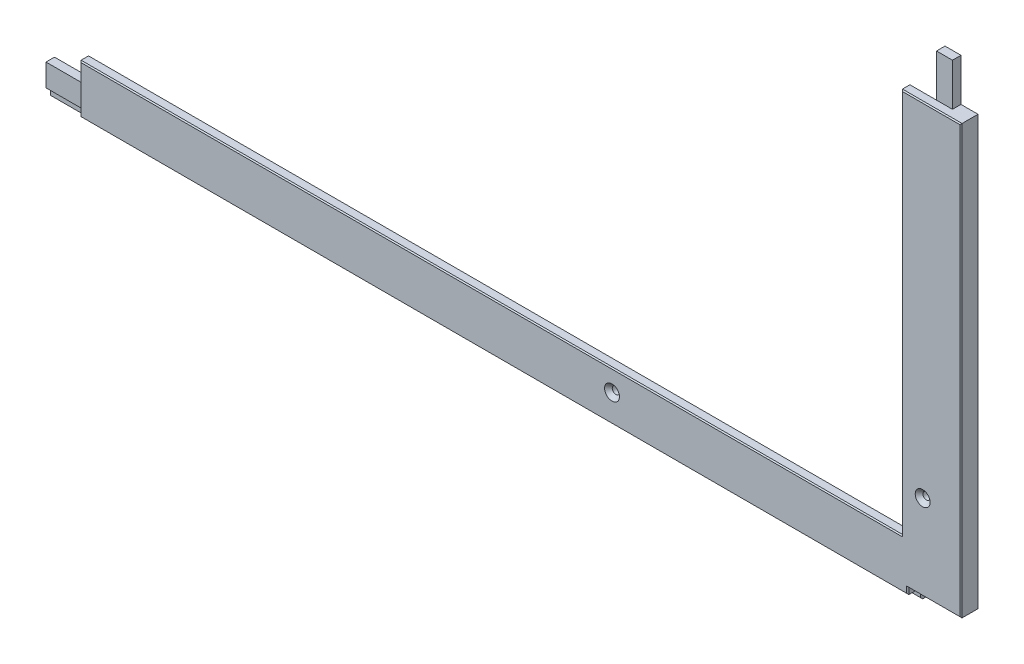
ISO-10303-21;
HEADER;
FILE_DESCRIPTION(('STEP AP214'),'2;1');
FILE_NAME('part.step','',(''),(''),'','','');
FILE_SCHEMA(('AUTOMOTIVE_DESIGN { 1 0 10303 214 1 1 1 1 }'));
ENDSEC;
DATA;
#1=APPLICATION_CONTEXT('core data for automotive mechanical design processes');
#2=APPLICATION_PROTOCOL_DEFINITION('international standard','automotive_design',2000,#1);
#3=PRODUCT_CONTEXT('',#1,'mechanical');
#4=PRODUCT('Part','Part','',(#3));
#5=PRODUCT_RELATED_PRODUCT_CATEGORY('part','',(#4));
#6=PRODUCT_DEFINITION_FORMATION('','',#4);
#7=PRODUCT_DEFINITION_CONTEXT('part definition',#1,'design');
#8=PRODUCT_DEFINITION('design','',#6,#7);
#9=PRODUCT_DEFINITION_SHAPE('','',#8);
#10=(LENGTH_UNIT() NAMED_UNIT(*) SI_UNIT(.MILLI.,.METRE.));
#11=(NAMED_UNIT(*) PLANE_ANGLE_UNIT() SI_UNIT($,.RADIAN.));
#12=(NAMED_UNIT(*) SI_UNIT($,.STERADIAN.) SOLID_ANGLE_UNIT());
#13=UNCERTAINTY_MEASURE_WITH_UNIT(LENGTH_MEASURE(1.E-05),#10,'distance_accuracy_value','');
#14=(GEOMETRIC_REPRESENTATION_CONTEXT(3) GLOBAL_UNCERTAINTY_ASSIGNED_CONTEXT((#13)) GLOBAL_UNIT_ASSIGNED_CONTEXT((#10,
#11,#12)) REPRESENTATION_CONTEXT('',''));
#15=CARTESIAN_POINT('',(0.,0.,0.));
#16=DIRECTION('',(0.,0.,1.));
#17=DIRECTION('',(1.,0.,0.));
#18=AXIS2_PLACEMENT_3D('',#15,#16,#17);
#19=CARTESIAN_POINT('',(0.,-214.25,0.));
#20=DIRECTION('',(0.,1.,0.));
#21=DIRECTION('',(0.,0.,1.));
#22=AXIS2_PLACEMENT_3D('',#19,#20,#21);
#23=PLANE('',#22);
#24=DIRECTION('',(0.,0.,1.));
#25=VECTOR('',#24,1.);
#26=CARTESIAN_POINT('',(399.,-214.25,8.));
#27=LINE('',#26,#25);
#28=CARTESIAN_POINT('',(399.,-214.25,2.));
#29=VERTEX_POINT('',#28);
#30=CARTESIAN_POINT('',(399.,-214.25,7.50000000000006));
#31=VERTEX_POINT('',#30);
#32=EDGE_CURVE('E223',#29,#31,#27,.T.);
#33=ORIENTED_EDGE('',*,*,#32,.T.);
#34=DIRECTION('',(-1.,0.,0.));
#35=VECTOR('',#34,1.);
#36=CARTESIAN_POINT('',(0.,-214.25,7.50000000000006));
#37=LINE('',#36,#35);
#38=CARTESIAN_POINT('',(9.99999999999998,-214.25,7.50000000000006));
#39=VERTEX_POINT('',#38);
#40=EDGE_CURVE('E382',#31,#39,#37,.T.);
#41=ORIENTED_EDGE('',*,*,#40,.T.);
#42=DIRECTION('',(0.,0.,-1.));
#43=VECTOR('',#42,1.);
#44=CARTESIAN_POINT('',(9.99999999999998,-214.25,8.));
#45=LINE('',#44,#43);
#46=CARTESIAN_POINT('',(10.,-214.25,4.));
#47=VERTEX_POINT('',#46);
#48=EDGE_CURVE('E241',#39,#47,#45,.T.);
#49=ORIENTED_EDGE('',*,*,#48,.T.);
#50=DIRECTION('',(-1.,0.,0.));
#51=VECTOR('',#50,1.);
#52=CARTESIAN_POINT('',(10.,-214.25,4.));
#53=LINE('',#52,#51);
#54=CARTESIAN_POINT('',(-10.,-214.25,4.));
#55=VERTEX_POINT('',#54);
#56=EDGE_CURVE('E222',#47,#55,#53,.T.);
#57=ORIENTED_EDGE('',*,*,#56,.T.);
#58=DIRECTION('',(0.,0.,-1.));
#59=VECTOR('',#58,1.);
#60=CARTESIAN_POINT('',(-10.,-214.25,4.));
#61=LINE('',#60,#59);
#62=CARTESIAN_POINT('',(-10.,-214.25,2.));
#63=VERTEX_POINT('',#62);
#64=EDGE_CURVE('E206',#55,#63,#61,.T.);
#65=ORIENTED_EDGE('',*,*,#64,.T.);
#66=DIRECTION('',(-1.,0.,0.));
#67=VECTOR('',#66,1.);
#68=CARTESIAN_POINT('',(-10.,-214.25,2.));
#69=LINE('',#68,#67);
#70=EDGE_CURVE('E219',#29,#63,#69,.T.);
#71=ORIENTED_EDGE('',*,*,#70,.F.);
#72=EDGE_LOOP('',(#33,#41,#49,#57,#65,#71));
#73=FACE_BOUND('',#72,.T.);
#74=ADVANCED_FACE('F38',(#73),#23,.F.);
#75=CARTESIAN_POINT('',(-416.,-211.25,8.));
#76=DIRECTION('',(0.,1.,0.));
#77=DIRECTION('',(0.,0.,1.));
#78=AXIS2_PLACEMENT_3D('',#75,#76,#77);
#79=PLANE('',#78);
#80=DIRECTION('',(0.,0.,-1.));
#81=VECTOR('',#80,1.);
#82=CARTESIAN_POINT('',(424.,-211.25,209.408943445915));
#83=LINE('',#82,#81);
#84=CARTESIAN_POINT('',(424.,-211.25,7.50000000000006));
#85=VERTEX_POINT('',#84);
#86=CARTESIAN_POINT('',(424.,-211.25,0.));
#87=VERTEX_POINT('',#86);
#88=EDGE_CURVE('E254',#85,#87,#83,.T.);
#89=ORIENTED_EDGE('',*,*,#88,.F.);
#90=DIRECTION('',(-1.,0.,0.));
#91=VECTOR('',#90,1.);
#92=CARTESIAN_POINT('',(-416.,-211.25,7.50000000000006));
#93=LINE('',#92,#91);
#94=CARTESIAN_POINT('',(399.,-211.25,7.50000000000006));
#95=VERTEX_POINT('',#94);
#96=EDGE_CURVE('E376',#85,#95,#93,.T.);
#97=ORIENTED_EDGE('',*,*,#96,.T.);
#98=DIRECTION('',(0.,0.,1.));
#99=VECTOR('',#98,1.);
#100=CARTESIAN_POINT('',(399.,-211.25,8.));
#101=LINE('',#100,#99);
#102=CARTESIAN_POINT('',(399.,-211.25,0.));
#103=VERTEX_POINT('',#102);
#104=EDGE_CURVE('E240',#103,#95,#101,.T.);
#105=ORIENTED_EDGE('',*,*,#104,.F.);
#106=DIRECTION('',(1.,0.,0.));
#107=VECTOR('',#106,1.);
#108=CARTESIAN_POINT('',(-416.,-211.25,0.));
#109=LINE('',#108,#107);
#110=EDGE_CURVE('E328',#103,#87,#109,.T.);
#111=ORIENTED_EDGE('',*,*,#110,.T.);
#112=EDGE_LOOP('',(#89,#97,#105,#111));
#113=FACE_BOUND('',#112,.T.);
#114=ADVANCED_FACE('F423',(#113),#79,.F.);
#115=CARTESIAN_POINT('',(396.,-191.25,8.));
#116=DIRECTION('',(-1.,0.,0.));
#117=DIRECTION('',(0.,0.,1.));
#118=AXIS2_PLACEMENT_3D('',#115,#116,#117);
#119=PLANE('',#118);
#120=DIRECTION('',(0.,0.,-1.));
#121=VECTOR('',#120,1.);
#122=CARTESIAN_POINT('',(396.,-191.25,8.));
#123=LINE('',#122,#121);
#124=CARTESIAN_POINT('',(396.,-191.25,7.50000000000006));
#125=VERTEX_POINT('',#124);
#126=CARTESIAN_POINT('',(396.,-191.25,4.));
#127=VERTEX_POINT('',#126);
#128=EDGE_CURVE('E324',#125,#127,#123,.T.);
#129=ORIENTED_EDGE('',*,*,#128,.F.);
#130=DIRECTION('',(0.,1.,0.));
#131=VECTOR('',#130,1.);
#132=CARTESIAN_POINT('',(396.,-10.,7.50000000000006));
#133=LINE('',#132,#131);
#134=CARTESIAN_POINT('',(396.,-10.,7.50000000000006));
#135=VERTEX_POINT('',#134);
#136=EDGE_CURVE('E370',#125,#135,#133,.T.);
#137=ORIENTED_EDGE('',*,*,#136,.T.);
#138=DIRECTION('',(0.,0.,-1.));
#139=VECTOR('',#138,1.);
#140=CARTESIAN_POINT('',(396.,-10.,8.00000000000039));
#141=LINE('',#140,#139);
#142=CARTESIAN_POINT('',(396.,-10.,4.));
#143=VERTEX_POINT('',#142);
#144=EDGE_CURVE('E292',#135,#143,#141,.T.);
#145=ORIENTED_EDGE('',*,*,#144,.T.);
#146=DIRECTION('',(0.,-1.,0.));
#147=VECTOR('',#146,1.);
#148=CARTESIAN_POINT('',(396.,-191.25,4.));
#149=LINE('',#148,#147);
#150=EDGE_CURVE('E321',#143,#127,#149,.T.);
#151=ORIENTED_EDGE('',*,*,#150,.T.);
#152=EDGE_LOOP('',(#129,#137,#145,#151));
#153=FACE_BOUND('',#152,.T.);
#154=ADVANCED_FACE('F502',(#153),#119,.T.);
#155=CARTESIAN_POINT('',(0.,0.,8.));
#156=DIRECTION('',(0.,0.,-1.));
#157=DIRECTION('',(-1.,0.,0.));
#158=AXIS2_PLACEMENT_3D('',#155,#156,#157);
#159=PLANE('',#158);
#160=DIRECTION('',(-1.,0.,0.));
#161=VECTOR('',#160,1.);
#162=CARTESIAN_POINT('',(9.99999999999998,-191.75,8.));
#163=LINE('',#162,#161);
#164=CARTESIAN_POINT('',(396.5,-191.75,8.));
#165=VERTEX_POINT('',#164);
#166=CARTESIAN_POINT('',(10.5,-191.75,8.));
#167=VERTEX_POINT('',#166);
#168=EDGE_CURVE('E363',#165,#167,#163,.T.);
#169=ORIENTED_EDGE('',*,*,#168,.T.);
#170=DIRECTION('',(0.,-1.,0.));
#171=VECTOR('',#170,1.);
#172=CARTESIAN_POINT('',(10.5,0.,8.));
#173=LINE('',#172,#171);
#174=CARTESIAN_POINT('',(10.5,-213.75,8.));
#175=VERTEX_POINT('',#174);
#176=EDGE_CURVE('E365',#167,#175,#173,.T.);
#177=ORIENTED_EDGE('',*,*,#176,.T.);
#178=DIRECTION('',(1.,0.,0.));
#179=VECTOR('',#178,1.);
#180=CARTESIAN_POINT('',(0.,-213.75,8.));
#181=LINE('',#180,#179);
#182=CARTESIAN_POINT('',(398.5,-213.75,8.));
#183=VERTEX_POINT('',#182);
#184=EDGE_CURVE('E351',#175,#183,#181,.T.);
#185=ORIENTED_EDGE('',*,*,#184,.T.);
#186=DIRECTION('',(0.,1.,0.));
#187=VECTOR('',#186,1.);
#188=CARTESIAN_POINT('',(398.5,0.,8.));
#189=LINE('',#188,#187);
#190=CARTESIAN_POINT('',(398.5,-210.75,8.));
#191=VERTEX_POINT('',#190);
#192=EDGE_CURVE('E353',#183,#191,#189,.T.);
#193=ORIENTED_EDGE('',*,*,#192,.T.);
#194=DIRECTION('',(1.,0.,0.));
#195=VECTOR('',#194,1.);
#196=CARTESIAN_POINT('',(0.,-210.75,8.));
#197=LINE('',#196,#195);
#198=CARTESIAN_POINT('',(423.5,-210.75,8.));
#199=VERTEX_POINT('',#198);
#200=EDGE_CURVE('E355',#191,#199,#197,.T.);
#201=ORIENTED_EDGE('',*,*,#200,.T.);
#202=DIRECTION('',(0.,1.,0.));
#203=VECTOR('',#202,1.);
#204=CARTESIAN_POINT('',(423.5,-10.,8.));
#205=LINE('',#204,#203);
#206=CARTESIAN_POINT('',(423.5,-10.5,8.));
#207=VERTEX_POINT('',#206);
#208=EDGE_CURVE('E357',#199,#207,#205,.T.);
#209=ORIENTED_EDGE('',*,*,#208,.T.);
#210=DIRECTION('',(-1.,0.,0.));
#211=VECTOR('',#210,1.);
#212=CARTESIAN_POINT('',(396.,-10.5,8.));
#213=LINE('',#212,#211);
#214=CARTESIAN_POINT('',(396.5,-10.5,8.));
#215=VERTEX_POINT('',#214);
#216=EDGE_CURVE('E359',#207,#215,#213,.T.);
#217=ORIENTED_EDGE('',*,*,#216,.T.);
#218=DIRECTION('',(0.,-1.,0.));
#219=VECTOR('',#218,1.);
#220=CARTESIAN_POINT('',(396.5,-191.25,8.));
#221=LINE('',#220,#219);
#222=EDGE_CURVE('E361',#215,#165,#221,.T.);
#223=ORIENTED_EDGE('',*,*,#222,.T.);
#224=EDGE_LOOP('',(#169,#177,#185,#193,#201,#209,#217,#223));
#225=FACE_BOUND('',#224,.T.);
#226=CARTESIAN_POINT('',(406.,-171.25,8.));
#227=DIRECTION('',(0.,0.,1.));
#228=DIRECTION('',(1.,0.,0.));
#229=AXIS2_PLACEMENT_3D('',#226,#227,#228);
#230=CIRCLE('',#229,3.5);
#231=CARTESIAN_POINT('',(409.5,-171.25,8.));
#232=VERTEX_POINT('',#231);
#233=EDGE_CURVE('E301',#232,#232,#230,.T.);
#234=ORIENTED_EDGE('',*,*,#233,.F.);
#235=EDGE_LOOP('',(#234));
#236=FACE_BOUND('',#235,.T.);
#237=CARTESIAN_POINT('',(260.,-201.25,8.));
#238=DIRECTION('',(0.,0.,1.));
#239=DIRECTION('',(1.,0.,0.));
#240=AXIS2_PLACEMENT_3D('',#237,#238,#239);
#241=CIRCLE('',#240,3.5);
#242=CARTESIAN_POINT('',(263.5,-201.25,8.));
#243=VERTEX_POINT('',#242);
#244=EDGE_CURVE('E294',#243,#243,#241,.T.);
#245=ORIENTED_EDGE('',*,*,#244,.F.);
#246=EDGE_LOOP('',(#245));
#247=FACE_BOUND('',#246,.T.);
#248=ADVANCED_FACE('F513',(#225,#236,#247),#159,.F.);
#249=CARTESIAN_POINT('',(0.,0.,0.));
#250=DIRECTION('',(0.,0.,-1.));
#251=DIRECTION('',(-1.,0.,0.));
#252=AXIS2_PLACEMENT_3D('',#249,#250,#251);
#253=PLANE('',#252);
#254=ORIENTED_EDGE('',*,*,#110,.F.);
#255=DIRECTION('',(-1.,0.,0.));
#256=VECTOR('',#255,1.);
#257=CARTESIAN_POINT('',(0.,-211.25,0.));
#258=LINE('',#257,#256);
#259=CARTESIAN_POINT('',(-10.,-211.25,0.));
#260=VERTEX_POINT('',#259);
#261=EDGE_CURVE('E391',#103,#260,#258,.T.);
#262=ORIENTED_EDGE('',*,*,#261,.T.);
#263=DIRECTION('',(0.,1.,0.));
#264=VECTOR('',#263,1.);
#265=CARTESIAN_POINT('',(-10.,-211.25,0.));
#266=LINE('',#265,#264);
#267=CARTESIAN_POINT('',(-10.,-203.75,0.));
#268=VERTEX_POINT('',#267);
#269=EDGE_CURVE('E263',#260,#268,#266,.T.);
#270=ORIENTED_EDGE('',*,*,#269,.T.);
#271=DIRECTION('',(-1.,0.,0.));
#272=VECTOR('',#271,1.);
#273=CARTESIAN_POINT('',(408.5,-203.75,0.));
#274=LINE('',#273,#272);
#275=CARTESIAN_POINT('',(408.5,-203.75,0.));
#276=VERTEX_POINT('',#275);
#277=EDGE_CURVE('E311',#276,#268,#274,.T.);
#278=ORIENTED_EDGE('',*,*,#277,.F.);
#279=DIRECTION('',(0.,-1.,0.));
#280=VECTOR('',#279,1.);
#281=CARTESIAN_POINT('',(408.5,203.75,0.));
#282=LINE('',#281,#280);
#283=CARTESIAN_POINT('',(408.5,10.,0.));
#284=VERTEX_POINT('',#283);
#285=EDGE_CURVE('E315',#284,#276,#282,.T.);
#286=ORIENTED_EDGE('',*,*,#285,.F.);
#287=DIRECTION('',(-1.,0.,0.));
#288=VECTOR('',#287,1.);
#289=CARTESIAN_POINT('',(416.,10.,0.));
#290=LINE('',#289,#288);
#291=CARTESIAN_POINT('',(416.,10.,0.));
#292=VERTEX_POINT('',#291);
#293=EDGE_CURVE('E279',#292,#284,#290,.T.);
#294=ORIENTED_EDGE('',*,*,#293,.F.);
#295=DIRECTION('',(0.,1.,0.));
#296=VECTOR('',#295,1.);
#297=CARTESIAN_POINT('',(416.,-211.25,0.));
#298=LINE('',#297,#296);
#299=CARTESIAN_POINT('',(416.,-10.,0.));
#300=VERTEX_POINT('',#299);
#301=EDGE_CURVE('E326',#300,#292,#298,.T.);
#302=ORIENTED_EDGE('',*,*,#301,.F.);
#303=DIRECTION('',(1.,0.,0.));
#304=VECTOR('',#303,1.);
#305=CARTESIAN_POINT('',(416.,-10.,0.));
#306=LINE('',#305,#304);
#307=CARTESIAN_POINT('',(424.,-10.,0.));
#308=VERTEX_POINT('',#307);
#309=EDGE_CURVE('E245',#300,#308,#306,.T.);
#310=ORIENTED_EDGE('',*,*,#309,.T.);
#311=DIRECTION('',(0.,-1.,0.));
#312=VECTOR('',#311,1.);
#313=CARTESIAN_POINT('',(424.,-10.,0.));
#314=LINE('',#313,#312);
#315=EDGE_CURVE('E250',#308,#87,#314,.T.);
#316=ORIENTED_EDGE('',*,*,#315,.T.);
#317=EDGE_LOOP('',(#254,#262,#270,#278,#286,#294,#302,#310,#316));
#318=FACE_BOUND('',#317,.T.);
#319=ADVANCED_FACE('F426',(#318),#253,.T.);
#320=CARTESIAN_POINT('',(416.,-211.25,8.));
#321=DIRECTION('',(-1.,0.,0.));
#322=DIRECTION('',(0.,0.,1.));
#323=AXIS2_PLACEMENT_3D('',#320,#321,#322);
#324=PLANE('',#323);
#325=DIRECTION('',(0.,1.,0.));
#326=VECTOR('',#325,1.);
#327=CARTESIAN_POINT('',(416.,-10.,4.));
#328=LINE('',#327,#326);
#329=CARTESIAN_POINT('',(416.,-10.,4.));
#330=VERTEX_POINT('',#329);
#331=CARTESIAN_POINT('',(416.,10.,4.));
#332=VERTEX_POINT('',#331);
#333=EDGE_CURVE('E274',#330,#332,#328,.T.);
#334=ORIENTED_EDGE('',*,*,#333,.F.);
#335=DIRECTION('',(0.,0.,-1.));
#336=VECTOR('',#335,1.);
#337=CARTESIAN_POINT('',(416.,-10.,209.408943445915));
#338=LINE('',#337,#336);
#339=EDGE_CURVE('E258',#330,#300,#338,.T.);
#340=ORIENTED_EDGE('',*,*,#339,.T.);
#341=ORIENTED_EDGE('',*,*,#301,.T.);
#342=DIRECTION('',(0.,0.,-1.));
#343=VECTOR('',#342,1.);
#344=CARTESIAN_POINT('',(416.,10.,4.));
#345=LINE('',#344,#343);
#346=EDGE_CURVE('E276',#332,#292,#345,.T.);
#347=ORIENTED_EDGE('',*,*,#346,.F.);
#348=EDGE_LOOP('',(#334,#340,#341,#347));
#349=FACE_BOUND('',#348,.T.);
#350=ADVANCED_FACE('F453',(#349),#324,.F.);
#351=CARTESIAN_POINT('',(408.5,203.75,4.));
#352=DIRECTION('',(1.,0.,0.));
#353=DIRECTION('',(0.,1.,0.));
#354=AXIS2_PLACEMENT_3D('',#351,#352,#353);
#355=PLANE('',#354);
#356=DIRECTION('',(0.,0.,1.));
#357=VECTOR('',#356,1.);
#358=CARTESIAN_POINT('',(408.5,10.,3.9999999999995));
#359=LINE('',#358,#357);
#360=CARTESIAN_POINT('',(408.5,10.,4.));
#361=VERTEX_POINT('',#360);
#362=EDGE_CURVE('E290',#284,#361,#359,.T.);
#363=ORIENTED_EDGE('',*,*,#362,.F.);
#364=ORIENTED_EDGE('',*,*,#285,.T.);
#365=DIRECTION('',(0.,0.,-1.));
#366=VECTOR('',#365,1.);
#367=CARTESIAN_POINT('',(408.5,-203.75,4.));
#368=LINE('',#367,#366);
#369=CARTESIAN_POINT('',(408.5,-203.75,4.));
#370=VERTEX_POINT('',#369);
#371=EDGE_CURVE('E314',#370,#276,#368,.T.);
#372=ORIENTED_EDGE('',*,*,#371,.F.);
#373=DIRECTION('',(0.,-1.,0.));
#374=VECTOR('',#373,1.);
#375=CARTESIAN_POINT('',(408.5,203.75,4.));
#376=LINE('',#375,#374);
#377=CARTESIAN_POINT('',(408.5,-10.,4.));
#378=VERTEX_POINT('',#377);
#379=EDGE_CURVE('E308',#378,#370,#376,.T.);
#380=ORIENTED_EDGE('',*,*,#379,.F.);
#381=DIRECTION('',(0.,-1.,0.));
#382=VECTOR('',#381,1.);
#383=CARTESIAN_POINT('',(408.5,203.75,4.));
#384=LINE('',#383,#382);
#385=EDGE_CURVE('E287',#361,#378,#384,.T.);
#386=ORIENTED_EDGE('',*,*,#385,.F.);
#387=EDGE_LOOP('',(#363,#364,#372,#380,#386));
#388=FACE_BOUND('',#387,.T.);
#389=ADVANCED_FACE('F441',(#388),#355,.F.);
#390=CARTESIAN_POINT('',(0.,0.,4.));
#391=DIRECTION('',(0.,0.,-1.));
#392=DIRECTION('',(-1.,0.,0.));
#393=AXIS2_PLACEMENT_3D('',#390,#391,#392);
#394=PLANE('',#393);
#395=DIRECTION('',(0.,1.,0.));
#396=VECTOR('',#395,1.);
#397=CARTESIAN_POINT('',(10.,-211.25,4.));
#398=LINE('',#397,#396);
#399=CARTESIAN_POINT('',(10.0000000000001,-203.75,4.));
#400=VERTEX_POINT('',#399);
#401=CARTESIAN_POINT('',(10.,-191.25,4.));
#402=VERTEX_POINT('',#401);
#403=EDGE_CURVE('E256',#400,#402,#398,.T.);
#404=ORIENTED_EDGE('',*,*,#403,.T.);
#405=DIRECTION('',(-1.,0.,0.));
#406=VECTOR('',#405,1.);
#407=CARTESIAN_POINT('',(-396.,-191.25,4.));
#408=LINE('',#407,#406);
#409=EDGE_CURVE('E331',#127,#402,#408,.T.);
#410=ORIENTED_EDGE('',*,*,#409,.F.);
#411=ORIENTED_EDGE('',*,*,#150,.F.);
#412=DIRECTION('',(-1.,0.,0.));
#413=VECTOR('',#412,1.);
#414=CARTESIAN_POINT('',(416.,-10.,4.));
#415=LINE('',#414,#413);
#416=EDGE_CURVE('E284',#378,#143,#415,.T.);
#417=ORIENTED_EDGE('',*,*,#416,.F.);
#418=ORIENTED_EDGE('',*,*,#379,.T.);
#419=DIRECTION('',(-1.,0.,0.));
#420=VECTOR('',#419,1.);
#421=CARTESIAN_POINT('',(408.5,-203.75,4.));
#422=LINE('',#421,#420);
#423=EDGE_CURVE('E310',#370,#400,#422,.T.);
#424=ORIENTED_EDGE('',*,*,#423,.T.);
#425=EDGE_LOOP('',(#404,#410,#411,#417,#418,#424));
#426=FACE_BOUND('',#425,.T.);
#427=CARTESIAN_POINT('',(260.,-201.25,4.));
#428=DIRECTION('',(0.,0.,-1.));
#429=DIRECTION('',(-1.,0.,0.));
#430=AXIS2_PLACEMENT_3D('',#427,#428,#429);
#431=CIRCLE('',#430,1.69999999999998);
#432=CARTESIAN_POINT('',(258.3,-201.25,4.));
#433=VERTEX_POINT('',#432);
#434=EDGE_CURVE('E300',#433,#433,#431,.T.);
#435=ORIENTED_EDGE('',*,*,#434,.F.);
#436=EDGE_LOOP('',(#435));
#437=FACE_BOUND('',#436,.T.);
#438=CARTESIAN_POINT('',(406.,-171.25,4.));
#439=DIRECTION('',(0.,0.,-1.));
#440=DIRECTION('',(-1.,0.,0.));
#441=AXIS2_PLACEMENT_3D('',#438,#439,#440);
#442=CIRCLE('',#441,1.69999999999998);
#443=CARTESIAN_POINT('',(404.3,-171.25,4.));
#444=VERTEX_POINT('',#443);
#445=EDGE_CURVE('E307',#444,#444,#442,.T.);
#446=ORIENTED_EDGE('',*,*,#445,.F.);
#447=EDGE_LOOP('',(#446));
#448=FACE_BOUND('',#447,.T.);
#449=ADVANCED_FACE('F748',(#426,#437,#448),#394,.T.);
#450=CARTESIAN_POINT('',(-396.,-191.25,8.));
#451=DIRECTION('',(0.,1.,0.));
#452=DIRECTION('',(0.,0.,1.));
#453=AXIS2_PLACEMENT_3D('',#450,#451,#452);
#454=PLANE('',#453);
#455=DIRECTION('',(0.,0.,-1.));
#456=VECTOR('',#455,1.);
#457=CARTESIAN_POINT('',(10.,-191.25,8.00000000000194));
#458=LINE('',#457,#456);
#459=CARTESIAN_POINT('',(10.,-191.25,7.50000000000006));
#460=VERTEX_POINT('',#459);
#461=EDGE_CURVE('E272',#460,#402,#458,.T.);
#462=ORIENTED_EDGE('',*,*,#461,.F.);
#463=DIRECTION('',(1.,0.,0.));
#464=VECTOR('',#463,1.);
#465=CARTESIAN_POINT('',(396.,-191.25,7.50000000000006));
#466=LINE('',#465,#464);
#467=EDGE_CURVE('E368',#460,#125,#466,.T.);
#468=ORIENTED_EDGE('',*,*,#467,.T.);
#469=ORIENTED_EDGE('',*,*,#128,.T.);
#470=ORIENTED_EDGE('',*,*,#409,.T.);
#471=EDGE_LOOP('',(#462,#468,#469,#470));
#472=FACE_BOUND('',#471,.T.);
#473=ADVANCED_FACE('F499',(#472),#454,.T.);
#474=CARTESIAN_POINT('',(408.5,-203.75,4.));
#475=DIRECTION('',(0.,-1.,0.));
#476=DIRECTION('',(0.,0.,-1.));
#477=AXIS2_PLACEMENT_3D('',#474,#475,#476);
#478=PLANE('',#477);
#479=ORIENTED_EDGE('',*,*,#277,.T.);
#480=DIRECTION('',(0.,0.,1.));
#481=VECTOR('',#480,1.);
#482=CARTESIAN_POINT('',(-10.,-203.75,4.00000000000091));
#483=LINE('',#482,#481);
#484=CARTESIAN_POINT('',(-10.,-203.75,4.));
#485=VERTEX_POINT('',#484);
#486=EDGE_CURVE('E262',#268,#485,#483,.T.);
#487=ORIENTED_EDGE('',*,*,#486,.T.);
#488=DIRECTION('',(1.,0.,0.));
#489=VECTOR('',#488,1.);
#490=CARTESIAN_POINT('',(408.5,-203.75,4.));
#491=LINE('',#490,#489);
#492=EDGE_CURVE('E265',#485,#400,#491,.T.);
#493=ORIENTED_EDGE('',*,*,#492,.T.);
#494=ORIENTED_EDGE('',*,*,#423,.F.);
#495=ORIENTED_EDGE('',*,*,#371,.T.);
#496=EDGE_LOOP('',(#479,#487,#493,#494,#495));
#497=FACE_BOUND('',#496,.T.);
#498=ADVANCED_FACE('F435',(#497),#478,.F.);
#499=CARTESIAN_POINT('',(406.,-171.25,8.));
#500=DIRECTION('',(0.,0.,1.));
#501=DIRECTION('',(1.,0.,0.));
#502=AXIS2_PLACEMENT_3D('',#499,#500,#501);
#503=CYLINDRICAL_SURFACE('',#502,1.69999999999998);
#504=ORIENTED_EDGE('',*,*,#445,.T.);
#505=EDGE_LOOP('',(#504));
#506=FACE_BOUND('',#505,.T.);
#507=CARTESIAN_POINT('',(406.,-171.25,6.2));
#508=DIRECTION('',(0.,0.,1.));
#509=DIRECTION('',(1.,0.,0.));
#510=AXIS2_PLACEMENT_3D('',#507,#508,#509);
#511=CIRCLE('',#510,1.69999999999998);
#512=CARTESIAN_POINT('',(407.7,-171.25,6.2));
#513=VERTEX_POINT('',#512);
#514=EDGE_CURVE('E304',#513,#513,#511,.T.);
#515=ORIENTED_EDGE('',*,*,#514,.T.);
#516=EDGE_LOOP('',(#515));
#517=FACE_BOUND('',#516,.T.);
#518=ADVANCED_FACE('F762',(#506,#517),#503,.F.);
#519=CARTESIAN_POINT('',(406.,-171.25,8.));
#520=DIRECTION('',(0.,0.,1.));
#521=DIRECTION('',(1.,0.,0.));
#522=AXIS2_PLACEMENT_3D('',#519,#520,#521);
#523=CONICAL_SURFACE('',#522,3.5,0.785398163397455);
#524=ORIENTED_EDGE('',*,*,#514,.F.);
#525=EDGE_LOOP('',(#524));
#526=FACE_BOUND('',#525,.T.);
#527=ORIENTED_EDGE('',*,*,#233,.T.);
#528=EDGE_LOOP('',(#527));
#529=FACE_BOUND('',#528,.T.);
#530=ADVANCED_FACE('F531',(#526,#529),#523,.F.);
#531=CARTESIAN_POINT('',(260.,-201.25,8.));
#532=DIRECTION('',(0.,0.,1.));
#533=DIRECTION('',(1.,0.,0.));
#534=AXIS2_PLACEMENT_3D('',#531,#532,#533);
#535=CYLINDRICAL_SURFACE('',#534,1.69999999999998);
#536=ORIENTED_EDGE('',*,*,#434,.T.);
#537=EDGE_LOOP('',(#536));
#538=FACE_BOUND('',#537,.T.);
#539=CARTESIAN_POINT('',(260.,-201.25,6.2));
#540=DIRECTION('',(0.,0.,1.));
#541=DIRECTION('',(1.,0.,0.));
#542=AXIS2_PLACEMENT_3D('',#539,#540,#541);
#543=CIRCLE('',#542,1.69999999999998);
#544=CARTESIAN_POINT('',(261.7,-201.25,6.2));
#545=VERTEX_POINT('',#544);
#546=EDGE_CURVE('E297',#545,#545,#543,.T.);
#547=ORIENTED_EDGE('',*,*,#546,.T.);
#548=EDGE_LOOP('',(#547));
#549=FACE_BOUND('',#548,.T.);
#550=ADVANCED_FACE('F523',(#538,#549),#535,.F.);
#551=CARTESIAN_POINT('',(260.,-201.25,8.));
#552=DIRECTION('',(0.,0.,1.));
#553=DIRECTION('',(1.,0.,0.));
#554=AXIS2_PLACEMENT_3D('',#551,#552,#553);
#555=CONICAL_SURFACE('',#554,3.5,0.785398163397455);
#556=ORIENTED_EDGE('',*,*,#546,.F.);
#557=EDGE_LOOP('',(#556));
#558=FACE_BOUND('',#557,.T.);
#559=ORIENTED_EDGE('',*,*,#244,.T.);
#560=EDGE_LOOP('',(#559));
#561=FACE_BOUND('',#560,.T.);
#562=ADVANCED_FACE('F521',(#558,#561),#555,.F.);
#563=CARTESIAN_POINT('',(416.,10.,4.));
#564=DIRECTION('',(0.,1.,0.));
#565=DIRECTION('',(0.,0.,1.));
#566=AXIS2_PLACEMENT_3D('',#563,#564,#565);
#567=PLANE('',#566);
#568=ORIENTED_EDGE('',*,*,#362,.T.);
#569=DIRECTION('',(-1.,0.,0.));
#570=VECTOR('',#569,1.);
#571=CARTESIAN_POINT('',(416.,10.,4.));
#572=LINE('',#571,#570);
#573=EDGE_CURVE('E281',#332,#361,#572,.T.);
#574=ORIENTED_EDGE('',*,*,#573,.F.);
#575=ORIENTED_EDGE('',*,*,#346,.T.);
#576=ORIENTED_EDGE('',*,*,#293,.T.);
#577=EDGE_LOOP('',(#568,#574,#575,#576));
#578=FACE_BOUND('',#577,.T.);
#579=ADVANCED_FACE('F445',(#578),#567,.T.);
#580=CARTESIAN_POINT('',(416.,-10.,4.));
#581=DIRECTION('',(0.,0.,1.));
#582=DIRECTION('',(1.,0.,0.));
#583=AXIS2_PLACEMENT_3D('',#580,#581,#582);
#584=PLANE('',#583);
#585=ORIENTED_EDGE('',*,*,#385,.T.);
#586=EDGE_CURVE('E285',#330,#378,#415,.T.);
#587=ORIENTED_EDGE('',*,*,#586,.F.);
#588=ORIENTED_EDGE('',*,*,#333,.T.);
#589=ORIENTED_EDGE('',*,*,#573,.T.);
#590=EDGE_LOOP('',(#585,#587,#588,#589));
#591=FACE_BOUND('',#590,.T.);
#592=ADVANCED_FACE('F448',(#591),#584,.T.);
#593=CARTESIAN_POINT('',(416.,-10.,7.99999999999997));
#594=DIRECTION('',(0.,1.,0.));
#595=DIRECTION('',(0.,0.,1.));
#596=AXIS2_PLACEMENT_3D('',#593,#594,#595);
#597=PLANE('',#596);
#598=ORIENTED_EDGE('',*,*,#144,.F.);
#599=DIRECTION('',(1.,0.,0.));
#600=VECTOR('',#599,1.);
#601=CARTESIAN_POINT('',(424.,-10.,7.50000000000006));
#602=LINE('',#601,#600);
#603=CARTESIAN_POINT('',(424.,-10.,7.50000000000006));
#604=VERTEX_POINT('',#603);
#605=EDGE_CURVE('E372',#135,#604,#602,.T.);
#606=ORIENTED_EDGE('',*,*,#605,.T.);
#607=DIRECTION('',(0.,0.,-1.));
#608=VECTOR('',#607,1.);
#609=CARTESIAN_POINT('',(424.,-10.,209.408943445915));
#610=LINE('',#609,#608);
#611=EDGE_CURVE('E253',#604,#308,#610,.T.);
#612=ORIENTED_EDGE('',*,*,#611,.T.);
#613=ORIENTED_EDGE('',*,*,#309,.F.);
#614=ORIENTED_EDGE('',*,*,#339,.F.);
#615=ORIENTED_EDGE('',*,*,#586,.T.);
#616=ORIENTED_EDGE('',*,*,#416,.T.);
#617=EDGE_LOOP('',(#598,#606,#612,#613,#614,#615,#616));
#618=FACE_BOUND('',#617,.T.);
#619=ADVANCED_FACE('F457',(#618),#597,.T.);
#620=CARTESIAN_POINT('',(-10.,-211.25,0.));
#621=DIRECTION('',(1.,0.,0.));
#622=DIRECTION('',(0.,0.,-1.));
#623=AXIS2_PLACEMENT_3D('',#620,#621,#622);
#624=PLANE('',#623);
#625=DIRECTION('',(0.,1.,0.));
#626=VECTOR('',#625,1.);
#627=CARTESIAN_POINT('',(-10.,-212.75,-1.));
#628=LINE('',#627,#626);
#629=CARTESIAN_POINT('',(-10.,-218.75,-1.));
#630=VERTEX_POINT('',#629);
#631=CARTESIAN_POINT('',(-10.,-212.25,-1.));
#632=VERTEX_POINT('',#631);
#633=EDGE_CURVE('E54',#630,#632,#628,.T.);
#634=ORIENTED_EDGE('',*,*,#633,.F.);
#635=DIRECTION('',(0.,-0.707106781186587,0.707106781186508));
#636=VECTOR('',#635,1.);
#637=CARTESIAN_POINT('',(-10.,-219.25,-0.500000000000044));
#638=LINE('',#637,#636);
#639=CARTESIAN_POINT('',(-10.,-219.25,-0.500000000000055));
#640=VERTEX_POINT('',#639);
#641=EDGE_CURVE('E389',#630,#640,#638,.T.);
#642=ORIENTED_EDGE('',*,*,#641,.T.);
#643=DIRECTION('',(0.,0.,-1.));
#644=VECTOR('',#643,1.);
#645=CARTESIAN_POINT('',(-10.,-219.25,-1.));
#646=LINE('',#645,#644);
#647=CARTESIAN_POINT('',(-10.,-219.25,1.00000000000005));
#648=VERTEX_POINT('',#647);
#649=EDGE_CURVE('E227',#648,#640,#646,.T.);
#650=ORIENTED_EDGE('',*,*,#649,.F.);
#651=DIRECTION('',(0.,-0.707106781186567,-0.707106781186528));
#652=VECTOR('',#651,1.);
#653=CARTESIAN_POINT('',(-10.,-219.25,1.00000000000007));
#654=LINE('',#653,#652);
#655=CARTESIAN_POINT('',(-10.,-218.25,2.));
#656=VERTEX_POINT('',#655);
#657=EDGE_CURVE('E208',#648,#656,#654,.F.);
#658=ORIENTED_EDGE('',*,*,#657,.T.);
#659=DIRECTION('',(0.,1.,0.));
#660=VECTOR('',#659,1.);
#661=CARTESIAN_POINT('',(-10.,-219.25,2.));
#662=LINE('',#661,#660);
#663=EDGE_CURVE('E202',#656,#63,#662,.T.);
#664=ORIENTED_EDGE('',*,*,#663,.T.);
#665=ORIENTED_EDGE('',*,*,#64,.F.);
#666=DIRECTION('',(0.,1.,0.));
#667=VECTOR('',#666,1.);
#668=CARTESIAN_POINT('',(-10.,-211.25,4.));
#669=LINE('',#668,#667);
#670=EDGE_CURVE('E266',#55,#485,#669,.T.);
#671=ORIENTED_EDGE('',*,*,#670,.T.);
#672=ORIENTED_EDGE('',*,*,#486,.F.);
#673=ORIENTED_EDGE('',*,*,#269,.F.);
#674=DIRECTION('',(0.,-0.707106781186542,-0.707106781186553));
#675=VECTOR('',#674,1.);
#676=CARTESIAN_POINT('',(-10.,-211.25,0.));
#677=LINE('',#676,#675);
#678=EDGE_CURVE('E11',#260,#632,#677,.T.);
#679=ORIENTED_EDGE('',*,*,#678,.T.);
#680=EDGE_LOOP('',(#634,#642,#650,#658,#664,#665,#671,#672,#673,#679));
#681=FACE_BOUND('',#680,.T.);
#682=ADVANCED_FACE('F204',(#681),#624,.F.);
#683=CARTESIAN_POINT('',(-10.,-211.25,4.));
#684=DIRECTION('',(0.,0.,-1.));
#685=DIRECTION('',(-1.,0.,0.));
#686=AXIS2_PLACEMENT_3D('',#683,#684,#685);
#687=PLANE('',#686);
#688=ORIENTED_EDGE('',*,*,#670,.F.);
#689=ORIENTED_EDGE('',*,*,#56,.F.);
#690=EDGE_CURVE('E268',#47,#400,#398,.T.);
#691=ORIENTED_EDGE('',*,*,#690,.T.);
#692=ORIENTED_EDGE('',*,*,#492,.F.);
#693=EDGE_LOOP('',(#688,#689,#691,#692));
#694=FACE_BOUND('',#693,.T.);
#695=ADVANCED_FACE('F552',(#694),#687,.F.);
#696=CARTESIAN_POINT('',(10.,-211.25,4.));
#697=DIRECTION('',(1.,0.,0.));
#698=DIRECTION('',(0.,0.,-1.));
#699=AXIS2_PLACEMENT_3D('',#696,#697,#698);
#700=PLANE('',#699);
#701=ORIENTED_EDGE('',*,*,#48,.F.);
#702=DIRECTION('',(0.,1.,0.));
#703=VECTOR('',#702,1.);
#704=CARTESIAN_POINT('',(9.99999999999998,-211.25,7.50000000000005));
#705=LINE('',#704,#703);
#706=EDGE_CURVE('E348',#39,#460,#705,.T.);
#707=ORIENTED_EDGE('',*,*,#706,.T.);
#708=ORIENTED_EDGE('',*,*,#461,.T.);
#709=ORIENTED_EDGE('',*,*,#403,.F.);
#710=ORIENTED_EDGE('',*,*,#690,.F.);
#711=EDGE_LOOP('',(#701,#707,#708,#709,#710));
#712=FACE_BOUND('',#711,.T.);
#713=ADVANCED_FACE('F482',(#712),#700,.F.);
#714=CARTESIAN_POINT('',(424.,-10.,209.408943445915));
#715=DIRECTION('',(1.,0.,0.));
#716=DIRECTION('',(0.,0.,-1.));
#717=AXIS2_PLACEMENT_3D('',#714,#715,#716);
#718=PLANE('',#717);
#719=ORIENTED_EDGE('',*,*,#611,.F.);
#720=DIRECTION('',(0.,-1.,0.));
#721=VECTOR('',#720,1.);
#722=CARTESIAN_POINT('',(424.,-211.25,7.50000000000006));
#723=LINE('',#722,#721);
#724=EDGE_CURVE('E374',#604,#85,#723,.T.);
#725=ORIENTED_EDGE('',*,*,#724,.T.);
#726=ORIENTED_EDGE('',*,*,#88,.T.);
#727=ORIENTED_EDGE('',*,*,#315,.F.);
#728=EDGE_LOOP('',(#719,#725,#726,#727));
#729=FACE_BOUND('',#728,.T.);
#730=ADVANCED_FACE('F462',(#729),#718,.T.);
#731=CARTESIAN_POINT('',(399.,-214.25,8.));
#732=DIRECTION('',(-1.,0.,0.));
#733=DIRECTION('',(0.,0.,1.));
#734=AXIS2_PLACEMENT_3D('',#731,#732,#733);
#735=PLANE('',#734);
#736=ORIENTED_EDGE('',*,*,#104,.T.);
#737=DIRECTION('',(0.,-1.,0.));
#738=VECTOR('',#737,1.);
#739=CARTESIAN_POINT('',(399.,-214.25,7.50000000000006));
#740=LINE('',#739,#738);
#741=EDGE_CURVE('E380',#95,#31,#740,.T.);
#742=ORIENTED_EDGE('',*,*,#741,.T.);
#743=ORIENTED_EDGE('',*,*,#32,.F.);
#744=DIRECTION('',(0.,1.,0.));
#745=VECTOR('',#744,1.);
#746=CARTESIAN_POINT('',(399.,-219.25,2.));
#747=LINE('',#746,#745);
#748=CARTESIAN_POINT('',(399.,-218.25,2.));
#749=VERTEX_POINT('',#748);
#750=EDGE_CURVE('E212',#749,#29,#747,.T.);
#751=ORIENTED_EDGE('',*,*,#750,.F.);
#752=DIRECTION('',(0.,0.707106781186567,0.707106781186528));
#753=VECTOR('',#752,1.);
#754=CARTESIAN_POINT('',(399.,-219.25,1.00000000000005));
#755=LINE('',#754,#753);
#756=CARTESIAN_POINT('',(399.,-219.25,1.00000000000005));
#757=VERTEX_POINT('',#756);
#758=EDGE_CURVE('E345',#749,#757,#755,.F.);
#759=ORIENTED_EDGE('',*,*,#758,.T.);
#760=DIRECTION('',(0.,0.,1.));
#761=VECTOR('',#760,1.);
#762=CARTESIAN_POINT('',(399.,-219.25,-1.));
#763=LINE('',#762,#761);
#764=CARTESIAN_POINT('',(399.,-219.25,-0.500000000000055));
#765=VERTEX_POINT('',#764);
#766=EDGE_CURVE('E213',#765,#757,#763,.T.);
#767=ORIENTED_EDGE('',*,*,#766,.F.);
#768=DIRECTION('',(0.,0.707106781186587,-0.707106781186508));
#769=VECTOR('',#768,1.);
#770=CARTESIAN_POINT('',(399.,-219.25,-0.500000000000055));
#771=LINE('',#770,#769);
#772=CARTESIAN_POINT('',(399.,-218.75,-1.));
#773=VERTEX_POINT('',#772);
#774=EDGE_CURVE('E378',#765,#773,#771,.T.);
#775=ORIENTED_EDGE('',*,*,#774,.T.);
#776=DIRECTION('',(0.,-1.,0.));
#777=VECTOR('',#776,1.);
#778=CARTESIAN_POINT('',(399.,-212.75,-1.));
#779=LINE('',#778,#777);
#780=CARTESIAN_POINT('',(399.,-212.25,-1.));
#781=VERTEX_POINT('',#780);
#782=EDGE_CURVE('E61',#781,#773,#779,.T.);
#783=ORIENTED_EDGE('',*,*,#782,.F.);
#784=DIRECTION('',(0.,0.707106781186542,0.707106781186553));
#785=VECTOR('',#784,1.);
#786=CARTESIAN_POINT('',(399.,-208.75,2.50000000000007));
#787=LINE('',#786,#785);
#788=EDGE_CURVE('E47',#781,#103,#787,.T.);
#789=ORIENTED_EDGE('',*,*,#788,.T.);
#790=EDGE_LOOP('',(#736,#742,#743,#751,#759,#767,#775,#783,#789));
#791=FACE_BOUND('',#790,.T.);
#792=ADVANCED_FACE('F415',(#791),#735,.F.);
#793=CARTESIAN_POINT('',(0.,0.,-1.));
#794=DIRECTION('',(0.,0.,-1.));
#795=DIRECTION('',(-1.,0.,0.));
#796=AXIS2_PLACEMENT_3D('',#793,#794,#795);
#797=PLANE('',#796);
#798=ORIENTED_EDGE('',*,*,#782,.T.);
#799=DIRECTION('',(-1.,0.,0.));
#800=VECTOR('',#799,1.);
#801=CARTESIAN_POINT('',(-10.,-218.75,-1.));
#802=LINE('',#801,#800);
#803=EDGE_CURVE('E387',#773,#630,#802,.T.);
#804=ORIENTED_EDGE('',*,*,#803,.T.);
#805=ORIENTED_EDGE('',*,*,#633,.T.);
#806=DIRECTION('',(1.,0.,0.));
#807=VECTOR('',#806,1.);
#808=CARTESIAN_POINT('',(399.,-212.25,-1.));
#809=LINE('',#808,#807);
#810=EDGE_CURVE('E412',#632,#781,#809,.T.);
#811=ORIENTED_EDGE('',*,*,#810,.T.);
#812=EDGE_LOOP('',(#798,#804,#805,#811));
#813=FACE_BOUND('',#812,.T.);
#814=ADVANCED_FACE('F544',(#813),#797,.T.);
#815=CARTESIAN_POINT('',(-10.,-219.25,2.));
#816=DIRECTION('',(0.,0.,-1.));
#817=DIRECTION('',(-1.,0.,0.));
#818=AXIS2_PLACEMENT_3D('',#815,#816,#817);
#819=PLANE('',#818);
#820=ORIENTED_EDGE('',*,*,#663,.F.);
#821=DIRECTION('',(1.,0.,0.));
#822=VECTOR('',#821,1.);
#823=CARTESIAN_POINT('',(-10.,-218.25,2.));
#824=LINE('',#823,#822);
#825=EDGE_CURVE('E343',#656,#749,#824,.T.);
#826=ORIENTED_EDGE('',*,*,#825,.T.);
#827=ORIENTED_EDGE('',*,*,#750,.T.);
#828=ORIENTED_EDGE('',*,*,#70,.T.);
#829=EDGE_LOOP('',(#820,#826,#827,#828));
#830=FACE_BOUND('',#829,.T.);
#831=ADVANCED_FACE('F225',(#830),#819,.F.);
#832=CARTESIAN_POINT('',(0.,-219.25,0.));
#833=DIRECTION('',(0.,1.,0.));
#834=DIRECTION('',(0.,0.,1.));
#835=AXIS2_PLACEMENT_3D('',#832,#833,#834);
#836=PLANE('',#835);
#837=ORIENTED_EDGE('',*,*,#649,.T.);
#838=DIRECTION('',(1.,0.,0.));
#839=VECTOR('',#838,1.);
#840=CARTESIAN_POINT('',(399.,-219.25,-0.500000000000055));
#841=LINE('',#840,#839);
#842=EDGE_CURVE('E384',#640,#765,#841,.T.);
#843=ORIENTED_EDGE('',*,*,#842,.T.);
#844=ORIENTED_EDGE('',*,*,#766,.T.);
#845=DIRECTION('',(-1.,0.,0.));
#846=VECTOR('',#845,1.);
#847=CARTESIAN_POINT('',(0.,-219.25,1.00000000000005));
#848=LINE('',#847,#846);
#849=EDGE_CURVE('E261',#757,#648,#848,.T.);
#850=ORIENTED_EDGE('',*,*,#849,.T.);
#851=EDGE_LOOP('',(#837,#843,#844,#850));
#852=FACE_BOUND('',#851,.T.);
#853=ADVANCED_FACE('F599',(#852),#836,.F.);
#854=CARTESIAN_POINT('',(0.,-219.25,1.00000000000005));
#855=DIRECTION('',(0.,0.707106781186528,-0.707106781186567));
#856=DIRECTION('',(-1.,0.,0.));
#857=AXIS2_PLACEMENT_3D('',#854,#855,#856);
#858=PLANE('',#857);
#859=ORIENTED_EDGE('',*,*,#758,.F.);
#860=ORIENTED_EDGE('',*,*,#825,.F.);
#861=ORIENTED_EDGE('',*,*,#657,.F.);
#862=ORIENTED_EDGE('',*,*,#849,.F.);
#863=EDGE_LOOP('',(#859,#860,#861,#862));
#864=FACE_BOUND('',#863,.T.);
#865=ADVANCED_FACE('F605',(#864),#858,.F.);
#866=CARTESIAN_POINT('',(423.5,0.,8.));
#867=DIRECTION('',(0.707106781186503,0.,0.707106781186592));
#868=DIRECTION('',(0.,-1.,0.));
#869=AXIS2_PLACEMENT_3D('',#866,#867,#868);
#870=PLANE('',#869);
#871=DIRECTION('',(-0.577350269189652,-0.577350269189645,0.57735026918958));
#872=VECTOR('',#871,1.);
#873=CARTESIAN_POINT('',(427.,-6.99999999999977,4.50000000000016));
#874=LINE('',#873,#872);
#875=EDGE_CURVE('E233',#207,#604,#874,.F.);
#876=ORIENTED_EDGE('',*,*,#875,.F.);
#877=ORIENTED_EDGE('',*,*,#208,.F.);
#878=DIRECTION('',(0.577350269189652,-0.577350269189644,-0.57735026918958));
#879=VECTOR('',#878,1.);
#880=CARTESIAN_POINT('',(282.33333333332,-69.5833333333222,149.166666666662));
#881=LINE('',#880,#879);
#882=EDGE_CURVE('E228',#85,#199,#881,.F.);
#883=ORIENTED_EDGE('',*,*,#882,.F.);
#884=ORIENTED_EDGE('',*,*,#724,.F.);
#885=EDGE_LOOP('',(#876,#877,#883,#884));
#886=FACE_BOUND('',#885,.T.);
#887=ADVANCED_FACE('F467',(#886),#870,.T.);
#888=CARTESIAN_POINT('',(0.,-210.75,8.));
#889=DIRECTION('',(0.,0.707106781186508,-0.707106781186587));
#890=DIRECTION('',(1.,0.,0.));
#891=AXIS2_PLACEMENT_3D('',#888,#889,#890);
#892=PLANE('',#891);
#893=ORIENTED_EDGE('',*,*,#882,.T.);
#894=ORIENTED_EDGE('',*,*,#200,.F.);
#895=DIRECTION('',(-0.577350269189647,0.577350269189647,0.577350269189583));
#896=VECTOR('',#895,1.);
#897=CARTESIAN_POINT('',(265.666666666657,-77.9166666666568,140.833333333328));
#898=LINE('',#897,#896);
#899=EDGE_CURVE('E405',#95,#191,#898,.T.);
#900=ORIENTED_EDGE('',*,*,#899,.F.);
#901=ORIENTED_EDGE('',*,*,#96,.F.);
#902=EDGE_LOOP('',(#893,#894,#900,#901));
#903=FACE_BOUND('',#902,.T.);
#904=ADVANCED_FACE('F470',(#903),#892,.F.);
#905=CARTESIAN_POINT('',(0.,-10.5,8.));
#906=DIRECTION('',(0.,0.707106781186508,0.707106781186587));
#907=DIRECTION('',(1.,0.,0.));
#908=AXIS2_PLACEMENT_3D('',#905,#906,#907);
#909=PLANE('',#908);
#910=ORIENTED_EDGE('',*,*,#875,.T.);
#911=ORIENTED_EDGE('',*,*,#605,.F.);
#912=DIRECTION('',(0.577350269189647,-0.577350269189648,0.577350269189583));
#913=VECTOR('',#912,1.);
#914=CARTESIAN_POINT('',(264.333333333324,121.666666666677,-124.166666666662));
#915=LINE('',#914,#913);
#916=EDGE_CURVE('E402',#215,#135,#915,.F.);
#917=ORIENTED_EDGE('',*,*,#916,.F.);
#918=ORIENTED_EDGE('',*,*,#216,.F.);
#919=EDGE_LOOP('',(#910,#911,#917,#918));
#920=FACE_BOUND('',#919,.T.);
#921=ADVANCED_FACE('F511',(#920),#909,.T.);
#922=CARTESIAN_POINT('',(398.5,0.,8.));
#923=DIRECTION('',(-0.707106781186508,0.,-0.707106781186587));
#924=DIRECTION('',(0.,1.,0.));
#925=AXIS2_PLACEMENT_3D('',#922,#923,#924);
#926=PLANE('',#925);
#927=ORIENTED_EDGE('',*,*,#899,.T.);
#928=ORIENTED_EDGE('',*,*,#192,.F.);
#929=DIRECTION('',(-0.577350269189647,0.577350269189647,0.577350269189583));
#930=VECTOR('',#929,1.);
#931=CARTESIAN_POINT('',(265.99999999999,-81.2499999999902,140.499999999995));
#932=LINE('',#931,#930);
#933=EDGE_CURVE('E399',#31,#183,#932,.T.);
#934=ORIENTED_EDGE('',*,*,#933,.F.);
#935=ORIENTED_EDGE('',*,*,#741,.F.);
#936=EDGE_LOOP('',(#927,#928,#934,#935));
#937=FACE_BOUND('',#936,.T.);
#938=ADVANCED_FACE('F475',(#937),#926,.F.);
#939=CARTESIAN_POINT('',(396.,-191.25,7.50000000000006));
#940=DIRECTION('',(-0.707106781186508,0.,0.707106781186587));
#941=DIRECTION('',(0.,-1.,0.));
#942=AXIS2_PLACEMENT_3D('',#939,#940,#941);
#943=PLANE('',#942);
#944=ORIENTED_EDGE('',*,*,#916,.T.);
#945=ORIENTED_EDGE('',*,*,#136,.F.);
#946=DIRECTION('',(0.577350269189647,-0.577350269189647,0.577350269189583));
#947=VECTOR('',#946,1.);
#948=CARTESIAN_POINT('',(131.99999999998,72.7500000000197,-256.49999999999));
#949=LINE('',#948,#947);
#950=EDGE_CURVE('E396',#165,#125,#949,.F.);
#951=ORIENTED_EDGE('',*,*,#950,.F.);
#952=ORIENTED_EDGE('',*,*,#222,.F.);
#953=EDGE_LOOP('',(#944,#945,#951,#952));
#954=FACE_BOUND('',#953,.T.);
#955=ADVANCED_FACE('F506',(#954),#943,.T.);
#956=CARTESIAN_POINT('',(0.,-214.25,7.50000000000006));
#957=DIRECTION('',(0.,0.707106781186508,-0.707106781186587));
#958=DIRECTION('',(-1.,0.,0.));
#959=AXIS2_PLACEMENT_3D('',#956,#957,#958);
#960=PLANE('',#959);
#961=ORIENTED_EDGE('',*,*,#933,.T.);
#962=ORIENTED_EDGE('',*,*,#184,.F.);
#963=DIRECTION('',(-0.577350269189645,-0.577350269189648,-0.577350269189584));
#964=VECTOR('',#963,1.);
#965=CARTESIAN_POINT('',(6.66666666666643,-217.583333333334,4.16666666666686));
#966=LINE('',#965,#964);
#967=EDGE_CURVE('E394',#39,#175,#966,.F.);
#968=ORIENTED_EDGE('',*,*,#967,.F.);
#969=ORIENTED_EDGE('',*,*,#40,.F.);
#970=EDGE_LOOP('',(#961,#962,#968,#969));
#971=FACE_BOUND('',#970,.T.);
#972=ADVANCED_FACE('F487',(#971),#960,.F.);
#973=CARTESIAN_POINT('',(-396.,-191.25,7.50000000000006));
#974=DIRECTION('',(0.,0.707106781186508,0.707106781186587));
#975=DIRECTION('',(-1.,0.,0.));
#976=AXIS2_PLACEMENT_3D('',#973,#974,#975);
#977=PLANE('',#976);
#978=ORIENTED_EDGE('',*,*,#950,.T.);
#979=ORIENTED_EDGE('',*,*,#467,.F.);
#980=DIRECTION('',(-0.577350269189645,0.577350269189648,-0.577350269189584));
#981=VECTOR('',#980,1.);
#982=CARTESIAN_POINT('',(-125.333333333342,-55.9166666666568,-127.833333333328));
#983=LINE('',#982,#981);
#984=EDGE_CURVE('E392',#167,#460,#983,.T.);
#985=ORIENTED_EDGE('',*,*,#984,.F.);
#986=ORIENTED_EDGE('',*,*,#168,.F.);
#987=EDGE_LOOP('',(#978,#979,#985,#986));
#988=FACE_BOUND('',#987,.T.);
#989=ADVANCED_FACE('F495',(#988),#977,.T.);
#990=CARTESIAN_POINT('',(9.99999999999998,-211.25,7.50000000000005));
#991=DIRECTION('',(0.70710678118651,0.,-0.707106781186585));
#992=DIRECTION('',(0.,1.,0.));
#993=AXIS2_PLACEMENT_3D('',#990,#991,#992);
#994=PLANE('',#993);
#995=ORIENTED_EDGE('',*,*,#967,.T.);
#996=ORIENTED_EDGE('',*,*,#176,.F.);
#997=ORIENTED_EDGE('',*,*,#984,.T.);
#998=ORIENTED_EDGE('',*,*,#706,.F.);
#999=EDGE_LOOP('',(#995,#996,#997,#998));
#1000=FACE_BOUND('',#999,.T.);
#1001=ADVANCED_FACE('F490',(#1000),#994,.F.);
#1002=CARTESIAN_POINT('',(0.,-219.25,-0.500000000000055));
#1003=DIRECTION('',(0.,-0.707106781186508,-0.707106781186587));
#1004=DIRECTION('',(-1.,0.,0.));
#1005=AXIS2_PLACEMENT_3D('',#1002,#1003,#1004);
#1006=PLANE('',#1005);
#1007=ORIENTED_EDGE('',*,*,#641,.F.);
#1008=ORIENTED_EDGE('',*,*,#803,.F.);
#1009=ORIENTED_EDGE('',*,*,#774,.F.);
#1010=ORIENTED_EDGE('',*,*,#842,.F.);
#1011=EDGE_LOOP('',(#1007,#1008,#1009,#1010));
#1012=FACE_BOUND('',#1011,.T.);
#1013=ADVANCED_FACE('F661',(#1012),#1006,.T.);
#1014=CARTESIAN_POINT('',(399.,-212.75,-1.50000000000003));
#1015=DIRECTION('',(0.,-0.707106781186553,0.707106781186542));
#1016=DIRECTION('',(1.,0.,0.));
#1017=AXIS2_PLACEMENT_3D('',#1014,#1015,#1016);
#1018=PLANE('',#1017);
#1019=ORIENTED_EDGE('',*,*,#678,.F.);
#1020=ORIENTED_EDGE('',*,*,#261,.F.);
#1021=ORIENTED_EDGE('',*,*,#788,.F.);
#1022=ORIENTED_EDGE('',*,*,#810,.F.);
#1023=EDGE_LOOP('',(#1019,#1020,#1021,#1022));
#1024=FACE_BOUND('',#1023,.T.);
#1025=ADVANCED_FACE('F41',(#1024),#1018,.F.);
#1026=CLOSED_SHELL('',(#74,#114,#154,#248,#319,#350,#389,#449,#473,#498,#518,#530,#550,#562,
#579,#592,#619,#682,#695,#713,#730,#792,#814,#831,#853,#865,#887,#904,#921,#938,#955,#972,#989,
#1001,#1013,#1025));
#1027=MANIFOLD_SOLID_BREP('B2',#1026);
#1028=ADVANCED_BREP_SHAPE_REPRESENTATION('',(#18,#1027),#14);
#1029=SHAPE_DEFINITION_REPRESENTATION(#9,#1028);
ENDSEC;
END-ISO-10303-21;
